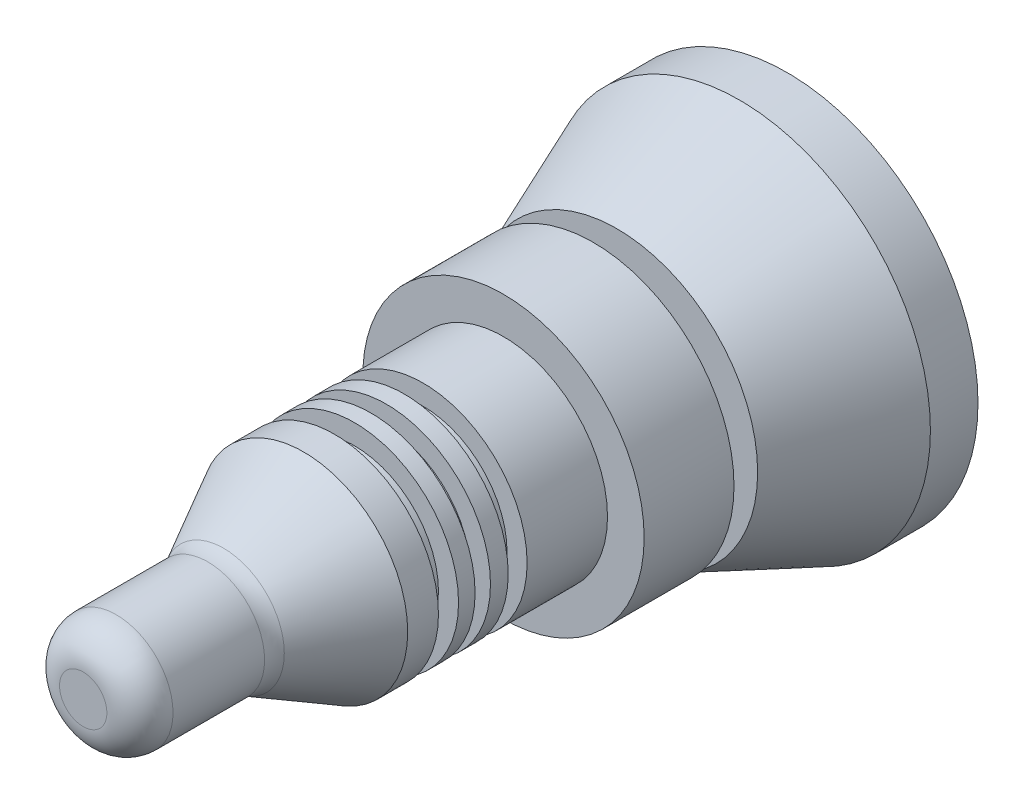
ISO-10303-21;
HEADER;
FILE_DESCRIPTION(('STEP AP214'),'2;1');
FILE_NAME('part.step','',(''),(''),'','','');
FILE_SCHEMA(('AUTOMOTIVE_DESIGN { 1 0 10303 214 1 1 1 1 }'));
ENDSEC;
DATA;
#1=APPLICATION_CONTEXT('core data for automotive mechanical design processes');
#2=APPLICATION_PROTOCOL_DEFINITION('international standard','automotive_design',2000,#1);
#3=PRODUCT_CONTEXT('',#1,'mechanical');
#4=PRODUCT('Part','Part','',(#3));
#5=PRODUCT_RELATED_PRODUCT_CATEGORY('part','',(#4));
#6=PRODUCT_DEFINITION_FORMATION('','',#4);
#7=PRODUCT_DEFINITION_CONTEXT('part definition',#1,'design');
#8=PRODUCT_DEFINITION('design','',#6,#7);
#9=PRODUCT_DEFINITION_SHAPE('','',#8);
#10=(LENGTH_UNIT() NAMED_UNIT(*) SI_UNIT(.MILLI.,.METRE.));
#11=(NAMED_UNIT(*) PLANE_ANGLE_UNIT() SI_UNIT($,.RADIAN.));
#12=(NAMED_UNIT(*) SI_UNIT($,.STERADIAN.) SOLID_ANGLE_UNIT());
#13=UNCERTAINTY_MEASURE_WITH_UNIT(LENGTH_MEASURE(1.E-05),#10,'distance_accuracy_value','');
#14=(GEOMETRIC_REPRESENTATION_CONTEXT(3) GLOBAL_UNCERTAINTY_ASSIGNED_CONTEXT((#13)) GLOBAL_UNIT_ASSIGNED_CONTEXT((#10,
#11,#12)) REPRESENTATION_CONTEXT('',''));
#15=CARTESIAN_POINT('',(0.,0.,0.));
#16=DIRECTION('',(0.,0.,1.));
#17=DIRECTION('',(1.,0.,0.));
#18=AXIS2_PLACEMENT_3D('',#15,#16,#17);
#19=CARTESIAN_POINT('',(0.,57.7128169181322,-212.836397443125));
#20=DIRECTION('',(0.,0.,1.));
#21=DIRECTION('',(1.,0.,0.));
#22=AXIS2_PLACEMENT_3D('',#19,#20,#21);
#23=PLANE('',#22);
#24=CARTESIAN_POINT('',(0.,0.,-212.836397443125));
#25=DIRECTION('',(0.,0.,1.));
#26=DIRECTION('',(1.,0.,0.));
#27=AXIS2_PLACEMENT_3D('',#24,#25,#26);
#28=CIRCLE('',#27,57.7128169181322);
#29=CARTESIAN_POINT('',(57.7128169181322,0.,-212.836397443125));
#30=VERTEX_POINT('',#29);
#31=EDGE_CURVE('E10',#30,#30,#28,.T.);
#32=ORIENTED_EDGE('',*,*,#31,.F.);
#33=EDGE_LOOP('',(#32));
#34=FACE_BOUND('',#33,.T.);
#35=ADVANCED_FACE('F22',(#34),#23,.F.);
#36=CARTESIAN_POINT('',(0.,0.,62.7325331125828));
#37=DIRECTION('',(0.,0.,1.));
#38=DIRECTION('',(1.,0.,0.));
#39=AXIS2_PLACEMENT_3D('',#36,#37,#38);
#40=CYLINDRICAL_SURFACE('',#39,57.7128169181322);
#41=CARTESIAN_POINT('',(0.,0.,-198.447054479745));
#42=DIRECTION('',(0.,0.,1.));
#43=DIRECTION('',(1.,0.,0.));
#44=AXIS2_PLACEMENT_3D('',#41,#42,#43);
#45=CIRCLE('',#44,57.7128169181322);
#46=CARTESIAN_POINT('',(57.7128169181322,0.,-198.447054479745));
#47=VERTEX_POINT('',#46);
#48=EDGE_CURVE('E28',#47,#47,#45,.T.);
#49=ORIENTED_EDGE('',*,*,#48,.F.);
#50=EDGE_LOOP('',(#49));
#51=FACE_BOUND('',#50,.T.);
#52=ORIENTED_EDGE('',*,*,#31,.T.);
#53=EDGE_LOOP('',(#52));
#54=FACE_BOUND('',#53,.T.);
#55=ADVANCED_FACE('F241',(#51,#54),#40,.T.);
#56=CARTESIAN_POINT('',(0.,0.,-198.447054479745));
#57=DIRECTION('',(0.,0.,-1.));
#58=DIRECTION('',(-1.,0.,0.));
#59=AXIS2_PLACEMENT_3D('',#56,#57,#58);
#60=CONICAL_SURFACE('',#59,57.7128169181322,0.388689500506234);
#61=CARTESIAN_POINT('',(0.,0.,-161.388824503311));
#62=DIRECTION('',(0.,0.,1.));
#63=DIRECTION('',(1.,0.,0.));
#64=AXIS2_PLACEMENT_3D('',#61,#62,#63);
#65=CIRCLE('',#64,42.5365894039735);
#66=CARTESIAN_POINT('',(42.5365894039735,0.,-161.388824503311));
#67=VERTEX_POINT('',#66);
#68=EDGE_CURVE('E32',#67,#67,#65,.T.);
#69=ORIENTED_EDGE('',*,*,#68,.F.);
#70=EDGE_LOOP('',(#69));
#71=FACE_BOUND('',#70,.T.);
#72=ORIENTED_EDGE('',*,*,#48,.T.);
#73=EDGE_LOOP('',(#72));
#74=FACE_BOUND('',#73,.T.);
#75=ADVANCED_FACE('F236',(#71,#74),#60,.T.);
#76=CARTESIAN_POINT('',(0.,22.876821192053,-161.388824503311));
#77=DIRECTION('',(0.,0.,-1.));
#78=DIRECTION('',(-1.,0.,0.));
#79=AXIS2_PLACEMENT_3D('',#76,#77,#78);
#80=PLANE('',#79);
#81=CARTESIAN_POINT('',(0.,0.,-161.388824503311));
#82=DIRECTION('',(0.,0.,1.));
#83=DIRECTION('',(1.,0.,0.));
#84=AXIS2_PLACEMENT_3D('',#81,#82,#83);
#85=CIRCLE('',#84,22.876821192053);
#86=CARTESIAN_POINT('',(22.876821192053,0.,-161.388824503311));
#87=VERTEX_POINT('',#86);
#88=EDGE_CURVE('E36',#87,#87,#85,.T.);
#89=ORIENTED_EDGE('',*,*,#88,.F.);
#90=EDGE_LOOP('',(#89));
#91=FACE_BOUND('',#90,.T.);
#92=ORIENTED_EDGE('',*,*,#68,.T.);
#93=EDGE_LOOP('',(#92));
#94=FACE_BOUND('',#93,.T.);
#95=ADVANCED_FACE('F230',(#91,#94),#80,.F.);
#96=CARTESIAN_POINT('',(0.,0.,62.7325331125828));
#97=DIRECTION('',(0.,0.,1.));
#98=DIRECTION('',(1.,0.,0.));
#99=AXIS2_PLACEMENT_3D('',#96,#97,#98);
#100=CYLINDRICAL_SURFACE('',#99,22.876821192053);
#101=CARTESIAN_POINT('',(0.,0.,-154.239817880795));
#102=DIRECTION('',(0.,0.,1.));
#103=DIRECTION('',(1.,0.,0.));
#104=AXIS2_PLACEMENT_3D('',#101,#102,#103);
#105=CIRCLE('',#104,22.876821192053);
#106=CARTESIAN_POINT('',(22.876821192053,0.,-154.239817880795));
#107=VERTEX_POINT('',#106);
#108=EDGE_CURVE('E41',#107,#107,#105,.T.);
#109=ORIENTED_EDGE('',*,*,#108,.F.);
#110=EDGE_LOOP('',(#109));
#111=FACE_BOUND('',#110,.T.);
#112=ORIENTED_EDGE('',*,*,#88,.T.);
#113=EDGE_LOOP('',(#112));
#114=FACE_BOUND('',#113,.T.);
#115=ADVANCED_FACE('F224',(#111,#114),#100,.T.);
#116=CARTESIAN_POINT('',(0.,42.5365894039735,-154.239817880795));
#117=DIRECTION('',(0.,0.,1.));
#118=DIRECTION('',(1.,0.,0.));
#119=AXIS2_PLACEMENT_3D('',#116,#117,#118);
#120=PLANE('',#119);
#121=CARTESIAN_POINT('',(0.,0.,-154.239817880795));
#122=DIRECTION('',(0.,0.,1.));
#123=DIRECTION('',(1.,0.,0.));
#124=AXIS2_PLACEMENT_3D('',#121,#122,#123);
#125=CIRCLE('',#124,42.5365894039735);
#126=CARTESIAN_POINT('',(42.5365894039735,0.,-154.239817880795));
#127=VERTEX_POINT('',#126);
#128=EDGE_CURVE('E44',#127,#127,#125,.T.);
#129=ORIENTED_EDGE('',*,*,#128,.F.);
#130=EDGE_LOOP('',(#129));
#131=FACE_BOUND('',#130,.T.);
#132=ORIENTED_EDGE('',*,*,#108,.T.);
#133=EDGE_LOOP('',(#132));
#134=FACE_BOUND('',#133,.T.);
#135=ADVANCED_FACE('F218',(#131,#134),#120,.F.);
#136=CARTESIAN_POINT('',(0.,0.,62.7325331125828));
#137=DIRECTION('',(0.,0.,1.));
#138=DIRECTION('',(1.,0.,0.));
#139=AXIS2_PLACEMENT_3D('',#136,#137,#138);
#140=CYLINDRICAL_SURFACE('',#139,42.5365894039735);
#141=CARTESIAN_POINT('',(0.,0.,-127.073592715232));
#142=DIRECTION('',(0.,0.,1.));
#143=DIRECTION('',(1.,0.,0.));
#144=AXIS2_PLACEMENT_3D('',#141,#142,#143);
#145=CIRCLE('',#144,42.5365894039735);
#146=CARTESIAN_POINT('',(42.5365894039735,0.,-127.073592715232));
#147=VERTEX_POINT('',#146);
#148=EDGE_CURVE('E47',#147,#147,#145,.T.);
#149=ORIENTED_EDGE('',*,*,#148,.F.);
#150=EDGE_LOOP('',(#149));
#151=FACE_BOUND('',#150,.T.);
#152=ORIENTED_EDGE('',*,*,#128,.T.);
#153=EDGE_LOOP('',(#152));
#154=FACE_BOUND('',#153,.T.);
#155=ADVANCED_FACE('F212',(#151,#154),#140,.T.);
#156=CARTESIAN_POINT('',(0.,31.4556291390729,-127.073592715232));
#157=DIRECTION('',(0.,0.,-1.));
#158=DIRECTION('',(-1.,0.,0.));
#159=AXIS2_PLACEMENT_3D('',#156,#157,#158);
#160=PLANE('',#159);
#161=CARTESIAN_POINT('',(0.,0.,-127.073592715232));
#162=DIRECTION('',(0.,0.,1.));
#163=DIRECTION('',(1.,0.,0.));
#164=AXIS2_PLACEMENT_3D('',#161,#162,#163);
#165=CIRCLE('',#164,31.4556291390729);
#166=CARTESIAN_POINT('',(31.4556291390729,0.,-127.073592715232));
#167=VERTEX_POINT('',#166);
#168=EDGE_CURVE('E50',#167,#167,#165,.T.);
#169=ORIENTED_EDGE('',*,*,#168,.F.);
#170=EDGE_LOOP('',(#169));
#171=FACE_BOUND('',#170,.T.);
#172=ORIENTED_EDGE('',*,*,#148,.T.);
#173=EDGE_LOOP('',(#172));
#174=FACE_BOUND('',#173,.T.);
#175=ADVANCED_FACE('F206',(#171,#174),#160,.F.);
#176=CARTESIAN_POINT('',(0.,0.,62.7325331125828));
#177=DIRECTION('',(0.,0.,1.));
#178=DIRECTION('',(1.,0.,0.));
#179=AXIS2_PLACEMENT_3D('',#176,#177,#178);
#180=CYLINDRICAL_SURFACE('',#179,31.4556291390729);
#181=CARTESIAN_POINT('',(0.,0.,-102.766970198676));
#182=DIRECTION('',(0.,0.,1.));
#183=DIRECTION('',(1.,0.,0.));
#184=AXIS2_PLACEMENT_3D('',#181,#182,#183);
#185=CIRCLE('',#184,31.4556291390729);
#186=CARTESIAN_POINT('',(31.4556291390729,0.,-102.766970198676));
#187=VERTEX_POINT('',#186);
#188=EDGE_CURVE('E53',#187,#187,#185,.T.);
#189=ORIENTED_EDGE('',*,*,#188,.F.);
#190=EDGE_LOOP('',(#189));
#191=FACE_BOUND('',#190,.T.);
#192=ORIENTED_EDGE('',*,*,#168,.T.);
#193=EDGE_LOOP('',(#192));
#194=FACE_BOUND('',#193,.T.);
#195=ADVANCED_FACE('F200',(#191,#194),#180,.T.);
#196=CARTESIAN_POINT('',(0.,25.3789735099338,-102.766970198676));
#197=DIRECTION('',(0.,0.,-1.));
#198=DIRECTION('',(-1.,0.,0.));
#199=AXIS2_PLACEMENT_3D('',#196,#197,#198);
#200=PLANE('',#199);
#201=CARTESIAN_POINT('',(0.,0.,-102.766970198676));
#202=DIRECTION('',(0.,0.,1.));
#203=DIRECTION('',(1.,0.,0.));
#204=AXIS2_PLACEMENT_3D('',#201,#202,#203);
#205=CIRCLE('',#204,25.3789735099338);
#206=CARTESIAN_POINT('',(25.3789735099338,0.,-102.766970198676));
#207=VERTEX_POINT('',#206);
#208=EDGE_CURVE('E56',#207,#207,#205,.T.);
#209=ORIENTED_EDGE('',*,*,#208,.F.);
#210=EDGE_LOOP('',(#209));
#211=FACE_BOUND('',#210,.T.);
#212=ORIENTED_EDGE('',*,*,#188,.T.);
#213=EDGE_LOOP('',(#212));
#214=FACE_BOUND('',#213,.T.);
#215=ADVANCED_FACE('F194',(#211,#214),#200,.F.);
#216=CARTESIAN_POINT('',(0.,0.,62.7325331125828));
#217=DIRECTION('',(0.,0.,1.));
#218=DIRECTION('',(1.,0.,0.));
#219=AXIS2_PLACEMENT_3D('',#216,#217,#218);
#220=CYLINDRICAL_SURFACE('',#219,25.3789735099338);
#221=CARTESIAN_POINT('',(0.,0.,-97.0477649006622));
#222=DIRECTION('',(0.,0.,1.));
#223=DIRECTION('',(1.,0.,0.));
#224=AXIS2_PLACEMENT_3D('',#221,#222,#223);
#225=CIRCLE('',#224,25.3789735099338);
#226=CARTESIAN_POINT('',(25.3789735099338,0.,-97.0477649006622));
#227=VERTEX_POINT('',#226);
#228=EDGE_CURVE('E59',#227,#227,#225,.T.);
#229=ORIENTED_EDGE('',*,*,#228,.F.);
#230=EDGE_LOOP('',(#229));
#231=FACE_BOUND('',#230,.T.);
#232=ORIENTED_EDGE('',*,*,#208,.T.);
#233=EDGE_LOOP('',(#232));
#234=FACE_BOUND('',#233,.T.);
#235=ADVANCED_FACE('F188',(#231,#234),#220,.T.);
#236=CARTESIAN_POINT('',(0.,31.4556291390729,-97.0477649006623));
#237=DIRECTION('',(0.,0.,1.));
#238=DIRECTION('',(1.,0.,0.));
#239=AXIS2_PLACEMENT_3D('',#236,#237,#238);
#240=PLANE('',#239);
#241=CARTESIAN_POINT('',(0.,0.,-97.0477649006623));
#242=DIRECTION('',(0.,0.,1.));
#243=DIRECTION('',(1.,0.,0.));
#244=AXIS2_PLACEMENT_3D('',#241,#242,#243);
#245=CIRCLE('',#244,31.4556291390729);
#246=CARTESIAN_POINT('',(31.4556291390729,0.,-97.0477649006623));
#247=VERTEX_POINT('',#246);
#248=EDGE_CURVE('E62',#247,#247,#245,.T.);
#249=ORIENTED_EDGE('',*,*,#248,.F.);
#250=EDGE_LOOP('',(#249));
#251=FACE_BOUND('',#250,.T.);
#252=ORIENTED_EDGE('',*,*,#228,.T.);
#253=EDGE_LOOP('',(#252));
#254=FACE_BOUND('',#253,.T.);
#255=ADVANCED_FACE('F182',(#251,#254),#240,.F.);
#256=CARTESIAN_POINT('',(0.,0.,62.7325331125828));
#257=DIRECTION('',(0.,0.,1.));
#258=DIRECTION('',(1.,0.,0.));
#259=AXIS2_PLACEMENT_3D('',#256,#257,#258);
#260=CYLINDRICAL_SURFACE('',#259,31.4556291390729);
#261=CARTESIAN_POINT('',(0.,0.,-91.6860099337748));
#262=DIRECTION('',(0.,0.,1.));
#263=DIRECTION('',(1.,0.,0.));
#264=AXIS2_PLACEMENT_3D('',#261,#262,#263);
#265=CIRCLE('',#264,31.4556291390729);
#266=CARTESIAN_POINT('',(31.4556291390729,0.,-91.6860099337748));
#267=VERTEX_POINT('',#266);
#268=EDGE_CURVE('E65',#267,#267,#265,.T.);
#269=ORIENTED_EDGE('',*,*,#268,.F.);
#270=EDGE_LOOP('',(#269));
#271=FACE_BOUND('',#270,.T.);
#272=ORIENTED_EDGE('',*,*,#248,.T.);
#273=EDGE_LOOP('',(#272));
#274=FACE_BOUND('',#273,.T.);
#275=ADVANCED_FACE('F176',(#271,#274),#260,.T.);
#276=CARTESIAN_POINT('',(0.,25.3789735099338,-91.6860099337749));
#277=DIRECTION('',(0.,0.,-1.));
#278=DIRECTION('',(-1.,0.,0.));
#279=AXIS2_PLACEMENT_3D('',#276,#277,#278);
#280=PLANE('',#279);
#281=CARTESIAN_POINT('',(0.,0.,-91.6860099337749));
#282=DIRECTION('',(0.,0.,1.));
#283=DIRECTION('',(1.,0.,0.));
#284=AXIS2_PLACEMENT_3D('',#281,#282,#283);
#285=CIRCLE('',#284,25.3789735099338);
#286=CARTESIAN_POINT('',(25.3789735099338,0.,-91.6860099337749));
#287=VERTEX_POINT('',#286);
#288=EDGE_CURVE('E68',#287,#287,#285,.T.);
#289=ORIENTED_EDGE('',*,*,#288,.F.);
#290=EDGE_LOOP('',(#289));
#291=FACE_BOUND('',#290,.T.);
#292=ORIENTED_EDGE('',*,*,#268,.T.);
#293=EDGE_LOOP('',(#292));
#294=FACE_BOUND('',#293,.T.);
#295=ADVANCED_FACE('F170',(#291,#294),#280,.F.);
#296=CARTESIAN_POINT('',(0.,0.,62.7325331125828));
#297=DIRECTION('',(0.,0.,1.));
#298=DIRECTION('',(1.,0.,0.));
#299=AXIS2_PLACEMENT_3D('',#296,#297,#298);
#300=CYLINDRICAL_SURFACE('',#299,25.3789735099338);
#301=CARTESIAN_POINT('',(0.,0.,-87.0391556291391));
#302=DIRECTION('',(0.,0.,1.));
#303=DIRECTION('',(1.,0.,0.));
#304=AXIS2_PLACEMENT_3D('',#301,#302,#303);
#305=CIRCLE('',#304,25.3789735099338);
#306=CARTESIAN_POINT('',(25.3789735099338,0.,-87.0391556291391));
#307=VERTEX_POINT('',#306);
#308=EDGE_CURVE('E71',#307,#307,#305,.T.);
#309=ORIENTED_EDGE('',*,*,#308,.F.);
#310=EDGE_LOOP('',(#309));
#311=FACE_BOUND('',#310,.T.);
#312=ORIENTED_EDGE('',*,*,#288,.T.);
#313=EDGE_LOOP('',(#312));
#314=FACE_BOUND('',#313,.T.);
#315=ADVANCED_FACE('F164',(#311,#314),#300,.T.);
#316=CARTESIAN_POINT('',(0.,31.4556291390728,-87.0391556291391));
#317=DIRECTION('',(0.,0.,1.));
#318=DIRECTION('',(1.,0.,0.));
#319=AXIS2_PLACEMENT_3D('',#316,#317,#318);
#320=PLANE('',#319);
#321=CARTESIAN_POINT('',(0.,0.,-87.0391556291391));
#322=DIRECTION('',(0.,0.,1.));
#323=DIRECTION('',(1.,0.,0.));
#324=AXIS2_PLACEMENT_3D('',#321,#322,#323);
#325=CIRCLE('',#324,31.4556291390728);
#326=CARTESIAN_POINT('',(31.4556291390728,0.,-87.0391556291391));
#327=VERTEX_POINT('',#326);
#328=EDGE_CURVE('E74',#327,#327,#325,.T.);
#329=ORIENTED_EDGE('',*,*,#328,.F.);
#330=EDGE_LOOP('',(#329));
#331=FACE_BOUND('',#330,.T.);
#332=ORIENTED_EDGE('',*,*,#308,.T.);
#333=EDGE_LOOP('',(#332));
#334=FACE_BOUND('',#333,.T.);
#335=ADVANCED_FACE('F158',(#331,#334),#320,.F.);
#336=CARTESIAN_POINT('',(0.,0.,62.7325331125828));
#337=DIRECTION('',(0.,0.,1.));
#338=DIRECTION('',(1.,0.,0.));
#339=AXIS2_PLACEMENT_3D('',#336,#337,#338);
#340=CYLINDRICAL_SURFACE('',#339,31.4556291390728);
#341=CARTESIAN_POINT('',(0.,0.,-82.0348509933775));
#342=DIRECTION('',(0.,0.,1.));
#343=DIRECTION('',(1.,0.,0.));
#344=AXIS2_PLACEMENT_3D('',#341,#342,#343);
#345=CIRCLE('',#344,31.4556291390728);
#346=CARTESIAN_POINT('',(31.4556291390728,0.,-82.0348509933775));
#347=VERTEX_POINT('',#346);
#348=EDGE_CURVE('E77',#347,#347,#345,.T.);
#349=ORIENTED_EDGE('',*,*,#348,.F.);
#350=EDGE_LOOP('',(#349));
#351=FACE_BOUND('',#350,.T.);
#352=ORIENTED_EDGE('',*,*,#328,.T.);
#353=EDGE_LOOP('',(#352));
#354=FACE_BOUND('',#353,.T.);
#355=ADVANCED_FACE('F152',(#351,#354),#340,.T.);
#356=CARTESIAN_POINT('',(0.,25.3789735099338,-82.0348509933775));
#357=DIRECTION('',(0.,0.,-1.));
#358=DIRECTION('',(-1.,0.,0.));
#359=AXIS2_PLACEMENT_3D('',#356,#357,#358);
#360=PLANE('',#359);
#361=CARTESIAN_POINT('',(0.,0.,-82.0348509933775));
#362=DIRECTION('',(0.,0.,1.));
#363=DIRECTION('',(1.,0.,0.));
#364=AXIS2_PLACEMENT_3D('',#361,#362,#363);
#365=CIRCLE('',#364,25.3789735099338);
#366=CARTESIAN_POINT('',(25.3789735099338,0.,-82.0348509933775));
#367=VERTEX_POINT('',#366);
#368=EDGE_CURVE('E80',#367,#367,#365,.T.);
#369=ORIENTED_EDGE('',*,*,#368,.F.);
#370=EDGE_LOOP('',(#369));
#371=FACE_BOUND('',#370,.T.);
#372=ORIENTED_EDGE('',*,*,#348,.T.);
#373=EDGE_LOOP('',(#372));
#374=FACE_BOUND('',#373,.T.);
#375=ADVANCED_FACE('F146',(#371,#374),#360,.F.);
#376=CARTESIAN_POINT('',(0.,0.,62.7325331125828));
#377=DIRECTION('',(0.,0.,1.));
#378=DIRECTION('',(1.,0.,0.));
#379=AXIS2_PLACEMENT_3D('',#376,#377,#378);
#380=CYLINDRICAL_SURFACE('',#379,25.3789735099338);
#381=CARTESIAN_POINT('',(0.,0.,-75.9581953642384));
#382=DIRECTION('',(0.,0.,1.));
#383=DIRECTION('',(1.,0.,0.));
#384=AXIS2_PLACEMENT_3D('',#381,#382,#383);
#385=CIRCLE('',#384,25.3789735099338);
#386=CARTESIAN_POINT('',(25.3789735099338,0.,-75.9581953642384));
#387=VERTEX_POINT('',#386);
#388=EDGE_CURVE('E83',#387,#387,#385,.T.);
#389=ORIENTED_EDGE('',*,*,#388,.F.);
#390=EDGE_LOOP('',(#389));
#391=FACE_BOUND('',#390,.T.);
#392=ORIENTED_EDGE('',*,*,#368,.T.);
#393=EDGE_LOOP('',(#392));
#394=FACE_BOUND('',#393,.T.);
#395=ADVANCED_FACE('F140',(#391,#394),#380,.T.);
#396=CARTESIAN_POINT('',(0.,31.4556291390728,-75.9581953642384));
#397=DIRECTION('',(0.,0.,1.));
#398=DIRECTION('',(1.,0.,0.));
#399=AXIS2_PLACEMENT_3D('',#396,#397,#398);
#400=PLANE('',#399);
#401=CARTESIAN_POINT('',(0.,0.,-75.9581953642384));
#402=DIRECTION('',(0.,0.,1.));
#403=DIRECTION('',(1.,0.,0.));
#404=AXIS2_PLACEMENT_3D('',#401,#402,#403);
#405=CIRCLE('',#404,31.4556291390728);
#406=CARTESIAN_POINT('',(31.4556291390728,0.,-75.9581953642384));
#407=VERTEX_POINT('',#406);
#408=EDGE_CURVE('E86',#407,#407,#405,.T.);
#409=ORIENTED_EDGE('',*,*,#408,.F.);
#410=EDGE_LOOP('',(#409));
#411=FACE_BOUND('',#410,.T.);
#412=ORIENTED_EDGE('',*,*,#388,.T.);
#413=EDGE_LOOP('',(#412));
#414=FACE_BOUND('',#413,.T.);
#415=ADVANCED_FACE('F134',(#411,#414),#400,.F.);
#416=CARTESIAN_POINT('',(0.,0.,62.7325331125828));
#417=DIRECTION('',(0.,0.,1.));
#418=DIRECTION('',(1.,0.,0.));
#419=AXIS2_PLACEMENT_3D('',#416,#417,#418);
#420=CYLINDRICAL_SURFACE('',#419,31.4556291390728);
#421=CARTESIAN_POINT('',(0.,0.,-66.6644867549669));
#422=DIRECTION('',(0.,0.,1.));
#423=DIRECTION('',(1.,0.,0.));
#424=AXIS2_PLACEMENT_3D('',#421,#422,#423);
#425=CIRCLE('',#424,31.4556291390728);
#426=CARTESIAN_POINT('',(31.4556291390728,0.,-66.6644867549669));
#427=VERTEX_POINT('',#426);
#428=EDGE_CURVE('E89',#427,#427,#425,.T.);
#429=ORIENTED_EDGE('',*,*,#428,.F.);
#430=EDGE_LOOP('',(#429));
#431=FACE_BOUND('',#430,.T.);
#432=ORIENTED_EDGE('',*,*,#408,.T.);
#433=EDGE_LOOP('',(#432));
#434=FACE_BOUND('',#433,.T.);
#435=ADVANCED_FACE('F128',(#431,#434),#420,.T.);
#436=CARTESIAN_POINT('',(0.,0.,-66.6644867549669));
#437=DIRECTION('',(0.,0.,-1.));
#438=DIRECTION('',(-1.,0.,0.));
#439=AXIS2_PLACEMENT_3D('',#436,#437,#438);
#440=CONICAL_SURFACE('',#439,31.4556291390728,0.495551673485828);
#441=CARTESIAN_POINT('',(0.,0.,-42.4385917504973));
#442=DIRECTION('',(0.,0.,1.));
#443=DIRECTION('',(1.,0.,0.));
#444=AXIS2_PLACEMENT_3D('',#441,#442,#443);
#445=CIRCLE('',#444,18.3605507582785);
#446=CARTESIAN_POINT('',(18.3605507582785,0.,-42.4385917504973));
#447=VERTEX_POINT('',#446);
#448=EDGE_CURVE('E92',#447,#447,#445,.T.);
#449=ORIENTED_EDGE('',*,*,#448,.F.);
#450=EDGE_LOOP('',(#449));
#451=FACE_BOUND('',#450,.T.);
#452=ORIENTED_EDGE('',*,*,#428,.T.);
#453=EDGE_LOOP('',(#452));
#454=FACE_BOUND('',#453,.T.);
#455=ADVANCED_FACE('F122',(#451,#454),#440,.T.);
#456=CARTESIAN_POINT('',(0.,0.,-37.6834214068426));
#457=DIRECTION('',(0.,0.,1.));
#458=DIRECTION('',(1.,0.,0.));
#459=AXIS2_PLACEMENT_3D('',#456,#457,#458);
#460=TOROIDAL_SURFACE('',#459,27.1576158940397,10.);
#461=CARTESIAN_POINT('',(0.,0.,-37.6834214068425));
#462=DIRECTION('',(0.,0.,1.));
#463=DIRECTION('',(1.,0.,0.));
#464=AXIS2_PLACEMENT_3D('',#461,#462,#463);
#465=CIRCLE('',#464,17.1576158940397);
#466=CARTESIAN_POINT('',(17.1576158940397,0.,-37.6834214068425));
#467=VERTEX_POINT('',#466);
#468=EDGE_CURVE('E95',#467,#467,#465,.T.);
#469=ORIENTED_EDGE('',*,*,#468,.F.);
#470=EDGE_LOOP('',(#469));
#471=FACE_BOUND('',#470,.T.);
#472=ORIENTED_EDGE('',*,*,#448,.T.);
#473=EDGE_LOOP('',(#472));
#474=FACE_BOUND('',#473,.T.);
#475=ADVANCED_FACE('F116',(#471,#474),#460,.F.);
#476=CARTESIAN_POINT('',(0.,0.,62.7325331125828));
#477=DIRECTION('',(0.,0.,1.));
#478=DIRECTION('',(1.,0.,0.));
#479=AXIS2_PLACEMENT_3D('',#476,#477,#478);
#480=CYLINDRICAL_SURFACE('',#479,17.1576158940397);
#481=CARTESIAN_POINT('',(0.,0.,-10.0000000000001));
#482=DIRECTION('',(0.,0.,1.));
#483=DIRECTION('',(1.,0.,0.));
#484=AXIS2_PLACEMENT_3D('',#481,#482,#483);
#485=CIRCLE('',#484,17.1576158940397);
#486=CARTESIAN_POINT('',(17.1576158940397,0.,-10.0000000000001));
#487=VERTEX_POINT('',#486);
#488=EDGE_CURVE('E98',#487,#487,#485,.T.);
#489=ORIENTED_EDGE('',*,*,#488,.F.);
#490=EDGE_LOOP('',(#489));
#491=FACE_BOUND('',#490,.T.);
#492=ORIENTED_EDGE('',*,*,#468,.T.);
#493=EDGE_LOOP('',(#492));
#494=FACE_BOUND('',#493,.T.);
#495=ADVANCED_FACE('F110',(#491,#494),#480,.T.);
#496=CARTESIAN_POINT('',(0.,0.,-9.99999999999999));
#497=DIRECTION('',(0.,0.,1.));
#498=DIRECTION('',(1.,0.,0.));
#499=AXIS2_PLACEMENT_3D('',#496,#497,#498);
#500=DEGENERATE_TOROIDAL_SURFACE('',#499,7.15761589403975,10.,.T.);
#501=CARTESIAN_POINT('',(0.,0.,0.));
#502=DIRECTION('',(0.,0.,1.));
#503=DIRECTION('',(1.,0.,0.));
#504=AXIS2_PLACEMENT_3D('',#501,#502,#503);
#505=CIRCLE('',#504,7.15761589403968);
#506=CARTESIAN_POINT('',(7.15761589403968,0.,0.));
#507=VERTEX_POINT('',#506);
#508=EDGE_CURVE('E101',#507,#507,#505,.T.);
#509=ORIENTED_EDGE('',*,*,#508,.F.);
#510=EDGE_LOOP('',(#509));
#511=FACE_BOUND('',#510,.T.);
#512=ORIENTED_EDGE('',*,*,#488,.T.);
#513=EDGE_LOOP('',(#512));
#514=FACE_BOUND('',#513,.T.);
#515=ADVANCED_FACE('F107',(#511,#514),#500,.T.);
#516=CARTESIAN_POINT('',(0.,0.,0.));
#517=DIRECTION('',(0.,0.,-1.));
#518=DIRECTION('',(-1.,0.,0.));
#519=AXIS2_PLACEMENT_3D('',#516,#517,#518);
#520=PLANE('',#519);
#521=ORIENTED_EDGE('',*,*,#508,.T.);
#522=EDGE_LOOP('',(#521));
#523=FACE_BOUND('',#522,.T.);
#524=ADVANCED_FACE('F105',(#523),#520,.F.);
#525=CLOSED_SHELL('',(#35,#55,#75,#95,#115,#135,#155,#175,#195,#215,#235,#255,#275,#295,#315,
#335,#355,#375,#395,#415,#435,#455,#475,#495,#515,#524));
#526=MANIFOLD_SOLID_BREP('B2',#525);
#527=ADVANCED_BREP_SHAPE_REPRESENTATION('',(#18,#526),#14);
#528=SHAPE_DEFINITION_REPRESENTATION(#9,#527);
ENDSEC;
END-ISO-10303-21;
